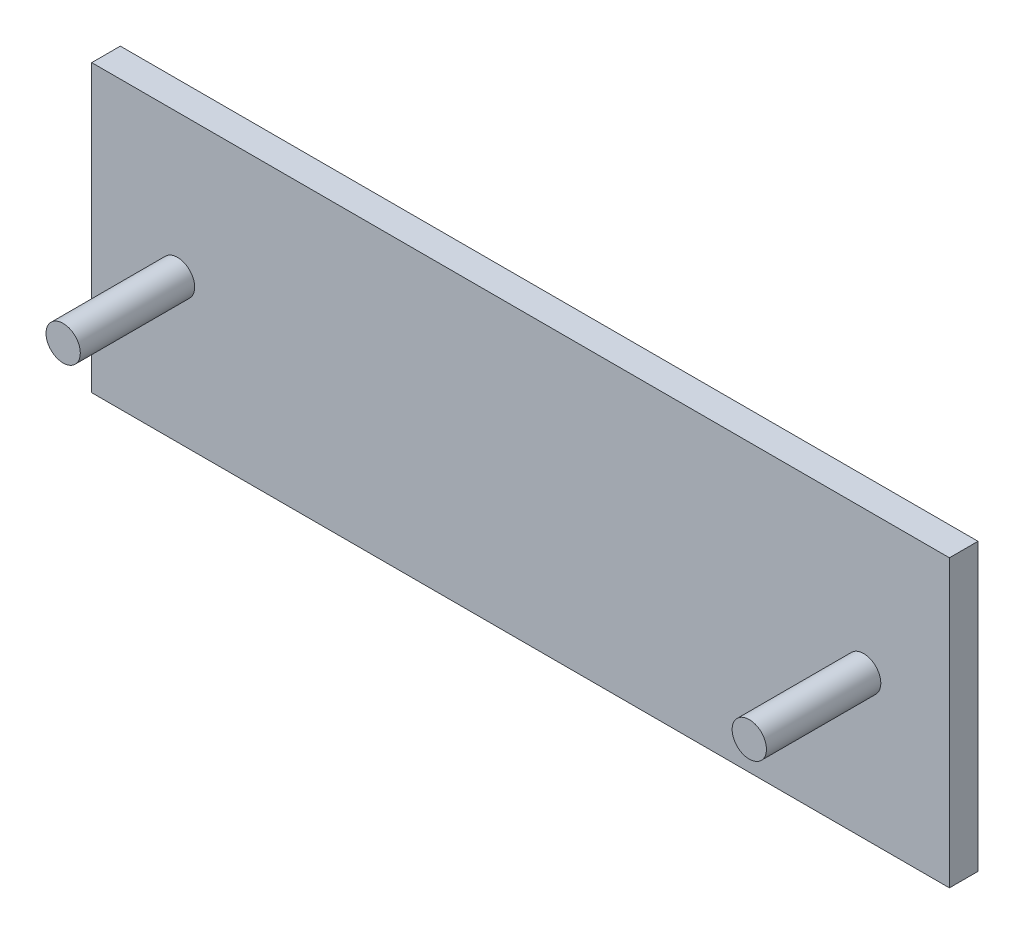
from build123d import *

# Parameters (mm, degrees)
SKIZZE1_W               = 300
SKIZZE1_H               = 100
LINEAR_AUSTRAGEN1_DEPTH = 10
SKIZZE2_R               = 6
LINEAR_AUSTRAGEN2_DEPTH = 40
SKIZZE3_R               = 6
LINEAR_AUSTRAGEN3_DEPTH = 40


with BuildPart() as part:
    # Skizze1 → Linear austragen1 (new body)
    with BuildSketch(Plane.XY):
        with Locations((150, 50)):
            Rectangle(SKIZZE1_W, SKIZZE1_H)
    extrude(amount=LINEAR_AUSTRAGEN1_DEPTH)

    # Skizze2 → Linear austragen2 (add)
    with BuildSketch(Plane.XY.offset(10)):
        with Locations(Location((30, 50, 0), (0, 0, 180))):
            Circle(SKIZZE2_R)
    extrude(amount=LINEAR_AUSTRAGEN2_DEPTH)

    # Skizze3 → Linear austragen3 (add)
    with BuildSketch(Plane.XY.offset(10)):
        with Locations(Location((270, 50, 0), (0, 0, 180))):
            Circle(SKIZZE3_R)
    extrude(amount=LINEAR_AUSTRAGEN3_DEPTH)


solid = part.part
